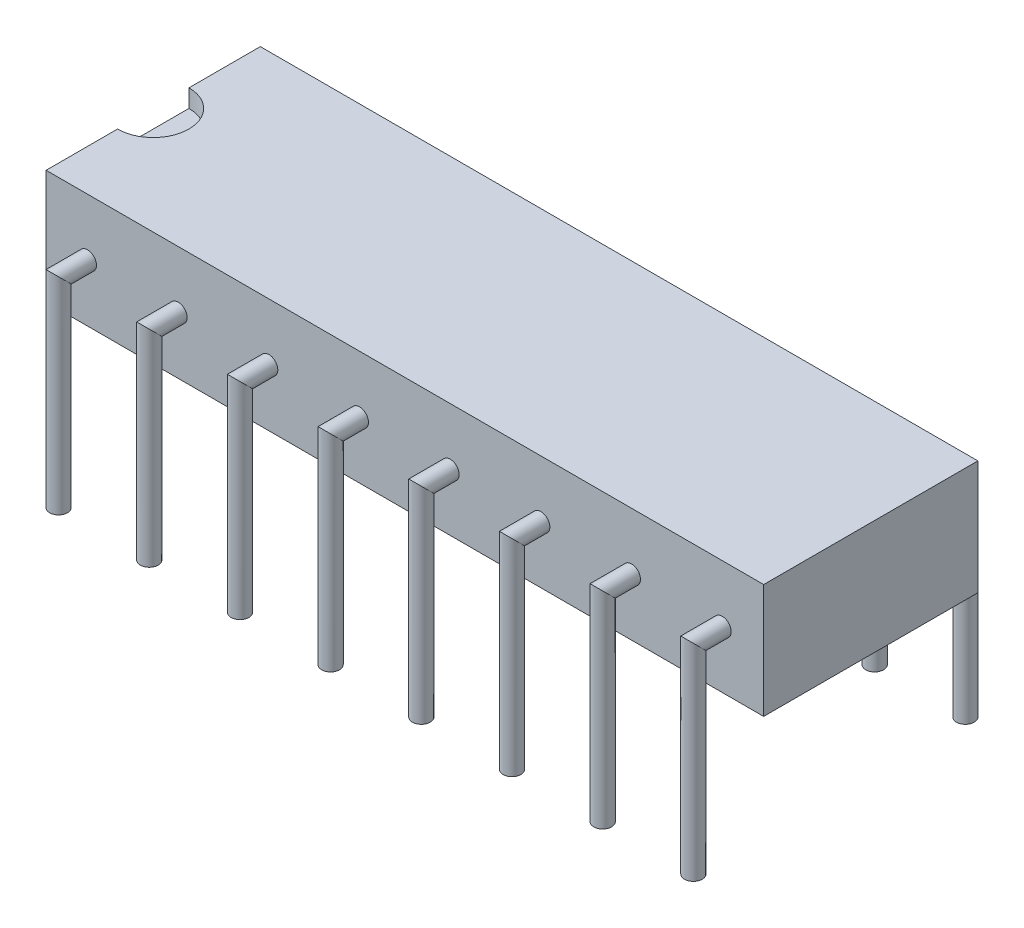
from build123d import *

# Parameters (mm, degrees)
ESQUISSE1_W                          = 6
ESQUISSE1_H                          = 3.2
EXTRUSION1_DEPTH                     = 20.1
ENL_V_MAT_EXTRU_1_DEPTH              = 0.5
ESQUISSE3_R                          = 0.25
R_P_TITION_LIN_AIRE1_COUNT           = 8
R_P_TITION_LIN_AIRE1_PITCH           = 2.54
R_P_TITION_LIN_AIRE1_COPY_1_SKETCH_R = 0.25
R_P_TITION_LIN_AIRE1_COPY_2_SKETCH_R = 0.25
R_P_TITION_LIN_AIRE1_COPY_3_SKETCH_R = 0.25
R_P_TITION_LIN_AIRE1_COPY_4_SKETCH_R = 0.25
R_P_TITION_LIN_AIRE1_COPY_5_SKETCH_R = 0.25
R_P_TITION_LIN_AIRE1_COPY_6_SKETCH_R = 0.25
R_P_TITION_LIN_AIRE1_COPY_7_SKETCH_R = 0.25


with BuildPart() as part:
    # Esquisse1 → Extrusion1 (new body)
    with BuildSketch(Plane(origin=(0, 0, 0), x_dir=(0, 0, -1), z_dir=(1, 0, 0))):
        with Locations((0, 1.6)):
            Rectangle(ESQUISSE1_W, ESQUISSE1_H)
    extrude(amount=EXTRUSION1_DEPTH)

    # Esquisse2 → Enl_v. mat.-Extru.1 (cut)
    with BuildSketch(Plane(origin=(0, 3.2, 0), x_dir=(-1, 0, 0), z_dir=(0, 1, 0))):
        with BuildLine():
            Line((0, -1), (0, 1))
            ThreePointArc((0, 1), (-1, 0), (0, -1))
        make_face()
    extrude(amount=-ENL_V_MAT_EXTRU_1_DEPTH, mode=Mode.SUBTRACT)

    # Balayage1: sweep along a path in Esquisse5
    with BuildLine(Plane(origin=(1.16, 0, 0), x_dir=(0, 0, -1), z_dir=(1, 0, 0))) as balayage1_path:
        Line((-3, 1.6), (-3.81, 1.6))
        Line((-3.81, 1.6), (-3.81, -4))
    # Esquisse3 → Balayage1 (sweep)
    with BuildSketch(Plane.XY.offset(3)):
        with Locations((1.16, 1.6)):
            Circle(ESQUISSE3_R)
    balayage1 = sweep(path=balayage1_path.line, transition=Transition.RIGHT)

    # Sym_trie1: Balayage1 across plane
    add(balayage1.mirror(Plane.XY))

    # R_p_tition lin_aire1: Balayage1 ×8
    with Locations(*[(i * R_P_TITION_LIN_AIRE1_PITCH, 0, 0) for i in range(1, R_P_TITION_LIN_AIRE1_COUNT)]):
        add(balayage1)

    # R_p_tition lin_aire1 copy 1: sweep along a path in R_p_tition lin_aire1 copy 1 path
    with BuildLine(Plane(origin=(3.7, 0, 0), x_dir=(0, 0, 1), z_dir=(1, 0, 0))) as r_p_tition_lin_aire1_copy_1_path:
        Line((-3, -1.6), (-3.81, -1.6))
        Line((-3.81, -1.6), (-3.81, 4))
    # R_p_tition lin_aire1 copy 1 sketch → R_p_tition lin_aire1 copy 1 (sweep)
    with BuildSketch(Plane(origin=(2.54, 0, -3), x_dir=(1, 0, 0), z_dir=(0, 0, -1))):
        with Locations((1.16, -1.6)):
            Circle(R_P_TITION_LIN_AIRE1_COPY_1_SKETCH_R)
    sweep(path=r_p_tition_lin_aire1_copy_1_path.line, transition=Transition.RIGHT)

    # R_p_tition lin_aire1 copy 2: sweep along a path in R_p_tition lin_aire1 copy 2 path
    with BuildLine(Plane(origin=(6.24, 0, 0), x_dir=(0, 0, 1), z_dir=(1, 0, 0))) as r_p_tition_lin_aire1_copy_2_path:
        Line((-3, -1.6), (-3.81, -1.6))
        Line((-3.81, -1.6), (-3.81, 4))
    # R_p_tition lin_aire1 copy 2 sketch → R_p_tition lin_aire1 copy 2 (sweep)
    with BuildSketch(Plane(origin=(5.08, 0, -3), x_dir=(1, 0, 0), z_dir=(0, 0, -1))):
        with Locations((1.16, -1.6)):
            Circle(R_P_TITION_LIN_AIRE1_COPY_2_SKETCH_R)
    sweep(path=r_p_tition_lin_aire1_copy_2_path.line, transition=Transition.RIGHT)

    # R_p_tition lin_aire1 copy 3: sweep along a path in R_p_tition lin_aire1 copy 3 path
    with BuildLine(Plane(origin=(8.78, 0, 0), x_dir=(0, 0, 1), z_dir=(1, 0, 0))) as r_p_tition_lin_aire1_copy_3_path:
        Line((-3, -1.6), (-3.81, -1.6))
        Line((-3.81, -1.6), (-3.81, 4))
    # R_p_tition lin_aire1 copy 3 sketch → R_p_tition lin_aire1 copy 3 (sweep)
    with BuildSketch(Plane(origin=(7.62, 0, -3), x_dir=(1, 0, 0), z_dir=(0, 0, -1))):
        with Locations((1.16, -1.6)):
            Circle(R_P_TITION_LIN_AIRE1_COPY_3_SKETCH_R)
    sweep(path=r_p_tition_lin_aire1_copy_3_path.line, transition=Transition.RIGHT)

    # R_p_tition lin_aire1 copy 4: sweep along a path in R_p_tition lin_aire1 copy 4 path
    with BuildLine(Plane(origin=(11.32, 0, 0), x_dir=(0, 0, 1), z_dir=(1, 0, 0))) as r_p_tition_lin_aire1_copy_4_path:
        Line((-3, -1.6), (-3.81, -1.6))
        Line((-3.81, -1.6), (-3.81, 4))
    # R_p_tition lin_aire1 copy 4 sketch → R_p_tition lin_aire1 copy 4 (sweep)
    with BuildSketch(Plane(origin=(10.16, 0, -3), x_dir=(1, 0, 0), z_dir=(0, 0, -1))):
        with Locations((1.16, -1.6)):
            Circle(R_P_TITION_LIN_AIRE1_COPY_4_SKETCH_R)
    sweep(path=r_p_tition_lin_aire1_copy_4_path.line, transition=Transition.RIGHT)

    # R_p_tition lin_aire1 copy 5: sweep along a path in R_p_tition lin_aire1 copy 5 path
    with BuildLine(Plane(origin=(13.86, 0, 0), x_dir=(0, 0, 1), z_dir=(1, 0, 0))) as r_p_tition_lin_aire1_copy_5_path:
        Line((-3, -1.6), (-3.81, -1.6))
        Line((-3.81, -1.6), (-3.81, 4))
    # R_p_tition lin_aire1 copy 5 sketch → R_p_tition lin_aire1 copy 5 (sweep)
    with BuildSketch(Plane(origin=(12.7, 0, -3), x_dir=(1, 0, 0), z_dir=(0, 0, -1))):
        with Locations((1.16, -1.6)):
            Circle(R_P_TITION_LIN_AIRE1_COPY_5_SKETCH_R)
    sweep(path=r_p_tition_lin_aire1_copy_5_path.line, transition=Transition.RIGHT)

    # R_p_tition lin_aire1 copy 6: sweep along a path in R_p_tition lin_aire1 copy 6 path
    with BuildLine(Plane(origin=(16.4, 0, 0), x_dir=(0, 0, 1), z_dir=(1, 0, 0))) as r_p_tition_lin_aire1_copy_6_path:
        Line((-3, -1.6), (-3.81, -1.6))
        Line((-3.81, -1.6), (-3.81, 4))
    # R_p_tition lin_aire1 copy 6 sketch → R_p_tition lin_aire1 copy 6 (sweep)
    with BuildSketch(Plane(origin=(15.24, 0, -3), x_dir=(1, 0, 0), z_dir=(0, 0, -1))):
        with Locations((1.16, -1.6)):
            Circle(R_P_TITION_LIN_AIRE1_COPY_6_SKETCH_R)
    sweep(path=r_p_tition_lin_aire1_copy_6_path.line, transition=Transition.RIGHT)

    # R_p_tition lin_aire1 copy 7: sweep along a path in R_p_tition lin_aire1 copy 7 path
    with BuildLine(Plane(origin=(18.94, 0, 0), x_dir=(0, 0, 1), z_dir=(1, 0, 0))) as r_p_tition_lin_aire1_copy_7_path:
        Line((-3, -1.6), (-3.81, -1.6))
        Line((-3.81, -1.6), (-3.81, 4))
    # R_p_tition lin_aire1 copy 7 sketch → R_p_tition lin_aire1 copy 7 (sweep)
    with BuildSketch(Plane(origin=(17.78, 0, -3), x_dir=(1, 0, 0), z_dir=(0, 0, -1))):
        with Locations((1.16, -1.6)):
            Circle(R_P_TITION_LIN_AIRE1_COPY_7_SKETCH_R)
    sweep(path=r_p_tition_lin_aire1_copy_7_path.line, transition=Transition.RIGHT)


solid = part.part
